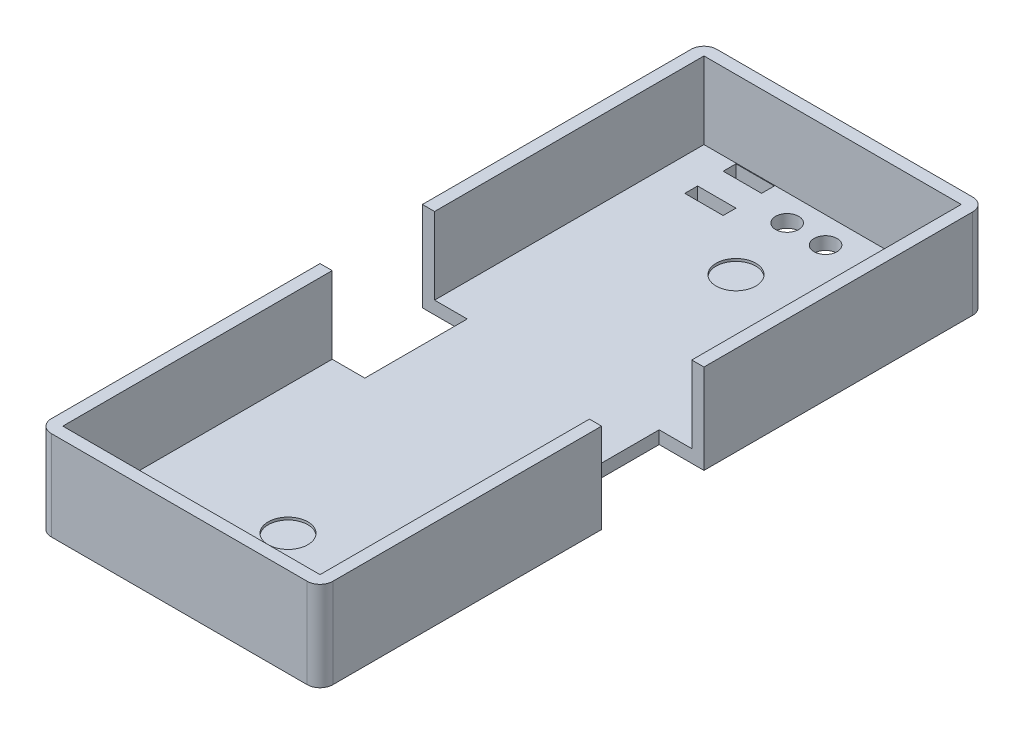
from build123d import *

# Parameters (mm, degrees)
SKETCH1_W           = 22
SKETCH1_H           = 52
BOSS_EXTRUDE1_DEPTH = 7
SKETCH2_W           = 20.1
SKETCH2_H           = 50.1
CUT_EXTRUDE1_DEPTH  = 6
FILLET1_R           = 1
SKETCH3_R           = 0.9
SKETCH3_W           = 3
SKETCH3_H           = 1
CUT_EXTRUDE2_DEPTH  = 3
SKETCH4_W           = 3.5
SKETCH4_H           = 8
CUT_EXTRUDE3_DEPTH  = 30.086079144
SKETCH5_R           = 1.55
CUT_EXTRUDE4_DEPTH  = 0.2


with BuildPart() as part:
    # Sketch1 → Boss-Extrude1 (new body)
    with BuildSketch(Plane(origin=(0, 0, 0), x_dir=(1, 0, 0), z_dir=(0, 1, 0))):
        Rectangle(SKETCH1_W, SKETCH1_H)
    extrude(amount=BOSS_EXTRUDE1_DEPTH)

    # Sketch2 → Cut-Extrude1 (cut)
    with BuildSketch(Plane(origin=(0, 7, 0), x_dir=(1, 0, 0), z_dir=(0, 1, 0))):
        Rectangle(SKETCH2_W, SKETCH2_H)
    extrude(amount=-CUT_EXTRUDE1_DEPTH, mode=Mode.SUBTRACT)

    # Fillet1
    fillet1_edges = [part.edges().sort_by_distance(p)[0] for p in [
        (11, 3.5, 26),
        (-11, 3.5, 26),
        (-11, 3.5, -26),
        (11, 3.5, -26),
    ]]
    fillet(fillet1_edges, radius=FILLET1_R)

    # Sketch3 → Cut-Extrude2 (cut)
    with BuildSketch(Plane.XZ):
        with Locations(Location((-1.5, -23, 0), (0, 0, 270))):
            Circle(SKETCH3_R)
        with Locations(Location((1.5, -23, 0), (0, 0, 270))):
            Circle(SKETCH3_R)
        with Locations((-6, -24.5)):
            Rectangle(SKETCH3_W, SKETCH3_H)
        with Locations((-6, -21.5)):
            Rectangle(SKETCH3_W, SKETCH3_H)
        with Locations((6, -21.5)):
            Rectangle(SKETCH3_W, SKETCH3_H)
        with Locations((6, -24.5)):
            Rectangle(SKETCH3_W, SKETCH3_H)
    extrude(amount=-CUT_EXTRUDE2_DEPTH, mode=Mode.SUBTRACT)

    # Sketch4 → Cut-Extrude3 (cut, through all)
    with BuildSketch(Plane.XZ):
        with Locations((-9.25, 0)):
            Rectangle(SKETCH4_W, SKETCH4_H)
        with Locations((9.25, 0)):
            Rectangle(SKETCH4_W, SKETCH4_H)
    extrude(amount=-CUT_EXTRUDE3_DEPTH, mode=Mode.SUBTRACT)

    # Sketch5 → Cut-Extrude4 (cut)
    with BuildSketch(Plane(origin=(0, 1, 0), x_dir=(1, 0, 0), z_dir=(0, 1, 0))):
        with Locations(Location((0, 17.5, 0), (0, 0, 270))):
            Circle(SKETCH5_R)
        with Locations(Location((0, -17.5, 0), (0, 0, 90))):
            Circle(SKETCH5_R)
    extrude(amount=-CUT_EXTRUDE4_DEPTH, mode=Mode.SUBTRACT)


solid = part.part
